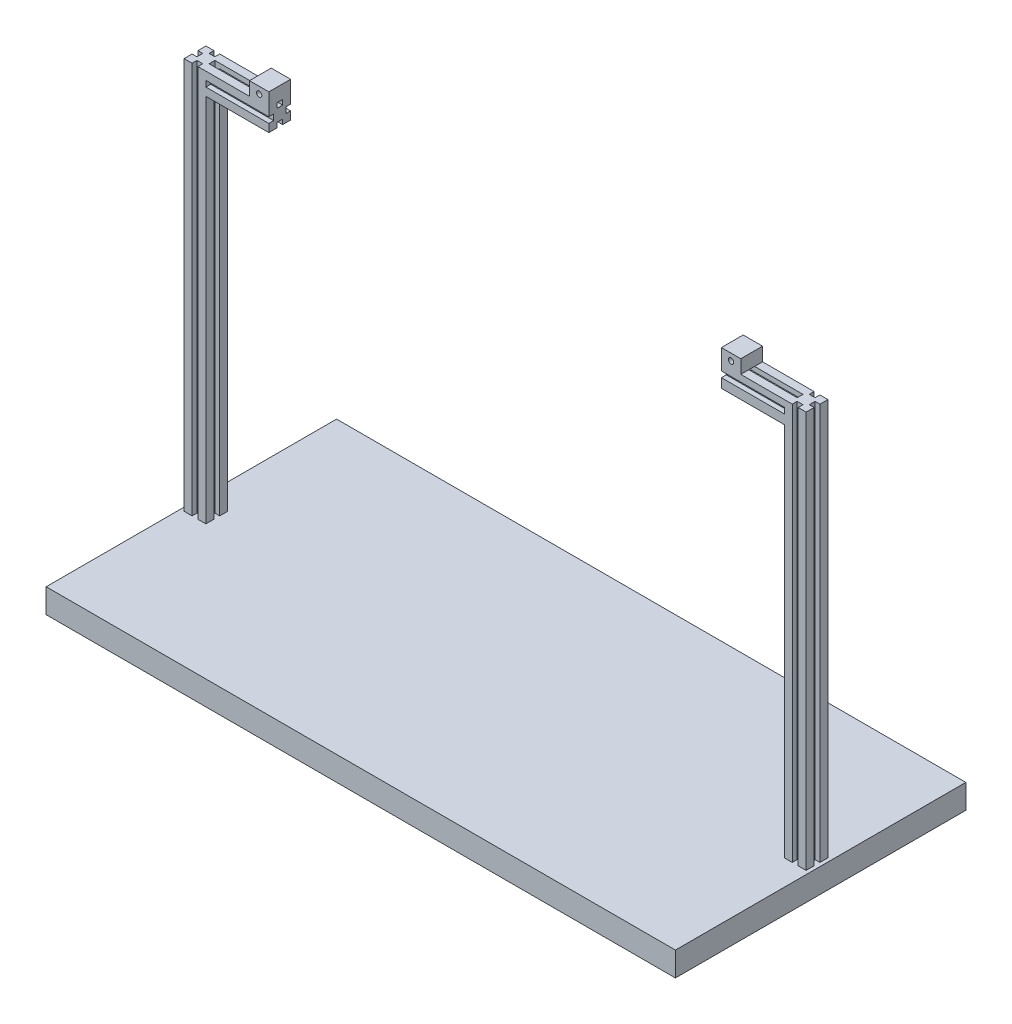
from build123d import *

# Parameters (mm, degrees)
SCHIZZO1_W                   = 1300
SCHIZZO1_H                   = 600
ESTRUSIONE_ESTRUSIONE1_DEPTH = 50
ESTRUSIONE_ESTRUSIONE2_DEPTH = 810
ESTRUSIONE_ESTRUSIONE3_DEPTH = 820
ESTRUSIONE_ESTRUSIONE4_DEPTH = 130
SCHIZZO4_W                   = 6
SCHIZZO4_H                   = 25
ESTRUSIONE_ESTRUSIONE5_DEPTH = 130
SCHIZZO5_W                   = 40
SCHIZZO5_H                   = 45
ESTRUSIONE_ESTRUSIONE6_DEPTH = 28
SCHIZZO6_R                   = 5.5
TAGLIO_ESTRUSIONE1_DEPTH     = 45
SCHIZZO7_W                   = 40
SCHIZZO7_H                   = 45
ESTRUSIONE_ESTRUSIONE7_DEPTH = 28
SCHIZZO8_R                   = 5.5
TAGLIO_ESTRUSIONE2_DEPTH     = 45


with BuildPart() as part:
    # Schizzo1 → Estrusione-Estrusione1 (new body)
    with BuildSketch(Plane(origin=(0, 0, 0), x_dir=(1, 0, 0), z_dir=(0, 1, 0))):
        Rectangle(SCHIZZO1_W, SCHIZZO1_H)
    extrude(amount=ESTRUSIONE_ESTRUSIONE1_DEPTH)

    # Schizzo2 → Estrusione-Estrusione2 (add)
    with BuildSketch(Plane(origin=(0, 50, 0), x_dir=(1, 0, 0), z_dir=(0, 1, 0))):
        Polygon((-626, 22.5), (-642.5, 22.5), (-642.5, 6), (-632.5, 6), (-632.5, -6), (-642.5, -6), (-642.5, -22.5), (-626, -22.5), (-626, -12.5), (-614, -12.5), (-614, -22.5), (-597.5, -22.5), (-597.5, -6), (-607.5, -6), (-607.5, 6), (-597.5, 6), (-597.5, 22.5), (-614, 22.5), (-614, 12.5), (-626, 12.5), align=None)
    extrude(amount=ESTRUSIONE_ESTRUSIONE2_DEPTH)

    # Schizzo2_3 → Estrusione-Estrusione3 (add)
    with BuildSketch(Plane(origin=(0, 50, 0), x_dir=(1, 0, 0), z_dir=(0, 1, 0))):
        Polygon((614, 22.5), (597.5, 22.5), (597.5, 6), (607.5, 6), (607.5, -6), (597.5, -6), (597.5, -22.5), (614, -22.5), (614, -12.5), (626, -12.5), (626, -22.5), (642.5, -22.5), (642.5, -6), (632.5, -6), (632.5, 6), (642.5, 6), (642.5, 22.5), (626, 22.5), (626, 12.5), (614, 12.5), align=None)
    extrude(amount=ESTRUSIONE_ESTRUSIONE3_DEPTH)

    # Schizzo3 → Estrusione-Estrusione4 (add)
    with BuildSketch(Plane.ZY.offset(-597.5)):
        Polygon((-6, 870), (-22.5, 870), (-22.5, 856.165156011), (-12.5, 856.165156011), (-12.5, 847.5), (-6, 847.5), (-6, 860), align=None)
        Polygon((-6, 835), (-6, 847.5), (-12.5, 847.5), (-12.5, 844.165156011), (-22.5, 844.165156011), (-22.5, 825), (-6, 825), align=None)
        Polygon((22.5, 870), (6, 870), (6, 860), (-6, 860), (-6, 847.5), (12.5, 847.5), (12.5, 856.165156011), (22.5, 856.165156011), align=None)
        Polygon((12.5, 847.5), (-6, 847.5), (-6, 835), (6, 835), (6, 825), (22.5, 825), (22.5, 844.165156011), (12.5, 844.165156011), align=None)
    extrude(amount=ESTRUSIONE_ESTRUSIONE4_DEPTH)

    # Schizzo4 → Estrusione-Estrusione5 (add)
    with BuildSketch(Plane(origin=(-597.5, 0, 0), x_dir=(0, 0, -1), z_dir=(1, 0, 0))):
        Polygon((22.5, 843.5), (22.5, 860), (6, 860), (6, 850), (0, 850), (0, 825), (6, 825), (6, 815), (22.5, 815), (22.5, 831.5), (12.5, 831.5), (12.5, 843.5), align=None)
        with Locations((-3, 837.5)):
            Rectangle(SCHIZZO4_W, SCHIZZO4_H)
        Polygon((-6, 850), (-6, 860), (-22.5, 860), (-22.5, 843.5), (-12.5, 843.5), (-12.5, 831.5), (-22.5, 831.5), (-22.5, 815), (-6, 815), (-6, 825), align=None)
    extrude(amount=ESTRUSIONE_ESTRUSIONE5_DEPTH)

    # Schizzo5 → Estrusione-Estrusione6 (add)
    with BuildSketch(Plane(origin=(0, 860, 0), x_dir=(1, 0, 0), z_dir=(0, 1, 0))):
        with Locations((-487.5, 0)):
            Rectangle(SCHIZZO5_W, SCHIZZO5_H)
    extrude(amount=ESTRUSIONE_ESTRUSIONE6_DEPTH)

    # Schizzo6 → Taglio-Estrusione1 (cut)
    with BuildSketch(Plane.XY.offset(22.5)):
        with Locations((-487.5, 874)):
            Circle(SCHIZZO6_R)
    extrude(amount=-TAGLIO_ESTRUSIONE1_DEPTH, mode=Mode.SUBTRACT)

    # Schizzo7 → Estrusione-Estrusione7 (add)
    with BuildSketch(Plane(origin=(0, 870, 0), x_dir=(1, 0, 0), z_dir=(0, 1, 0))):
        with Locations((487.5, 0)):
            Rectangle(SCHIZZO7_W, SCHIZZO7_H)
    extrude(amount=ESTRUSIONE_ESTRUSIONE7_DEPTH)

    # Schizzo8 → Taglio-Estrusione2 (cut)
    with BuildSketch(Plane.XY.offset(22.5)):
        with Locations((487.5, 884)):
            Circle(SCHIZZO8_R)
    extrude(amount=-TAGLIO_ESTRUSIONE2_DEPTH, mode=Mode.SUBTRACT)


solid = part.part
